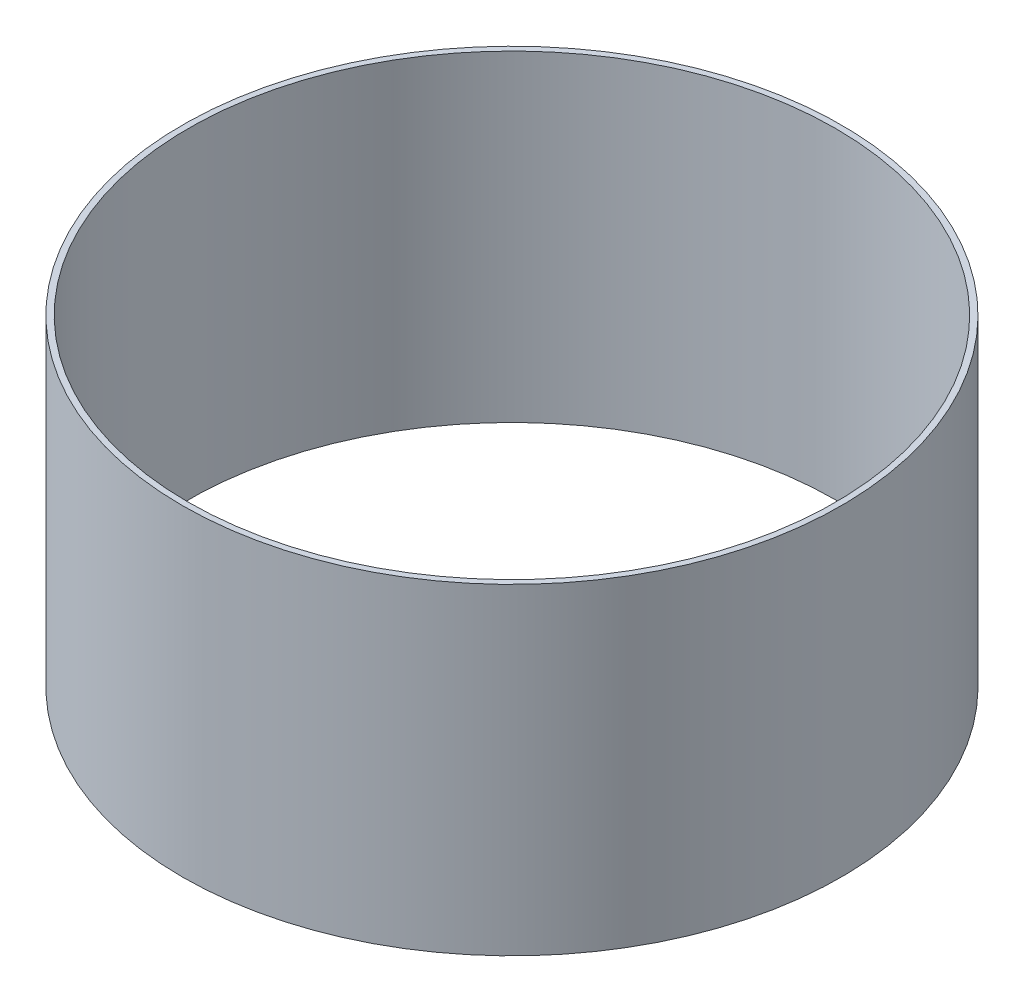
ISO-10303-21;
HEADER;
FILE_DESCRIPTION(('STEP AP214'),'2;1');
FILE_NAME('part.step','',(''),(''),'','','');
FILE_SCHEMA(('AUTOMOTIVE_DESIGN { 1 0 10303 214 1 1 1 1 }'));
ENDSEC;
DATA;
#1=APPLICATION_CONTEXT('core data for automotive mechanical design processes');
#2=APPLICATION_PROTOCOL_DEFINITION('international standard','automotive_design',2000,#1);
#3=PRODUCT_CONTEXT('',#1,'mechanical');
#4=PRODUCT('Part','Part','',(#3));
#5=PRODUCT_RELATED_PRODUCT_CATEGORY('part','',(#4));
#6=PRODUCT_DEFINITION_FORMATION('','',#4);
#7=PRODUCT_DEFINITION_CONTEXT('part definition',#1,'design');
#8=PRODUCT_DEFINITION('design','',#6,#7);
#9=PRODUCT_DEFINITION_SHAPE('','',#8);
#10=(LENGTH_UNIT() NAMED_UNIT(*) SI_UNIT(.MILLI.,.METRE.));
#11=(NAMED_UNIT(*) PLANE_ANGLE_UNIT() SI_UNIT($,.RADIAN.));
#12=(NAMED_UNIT(*) SI_UNIT($,.STERADIAN.) SOLID_ANGLE_UNIT());
#13=UNCERTAINTY_MEASURE_WITH_UNIT(LENGTH_MEASURE(1.E-05),#10,'distance_accuracy_value','');
#14=(GEOMETRIC_REPRESENTATION_CONTEXT(3) GLOBAL_UNCERTAINTY_ASSIGNED_CONTEXT((#13)) GLOBAL_UNIT_ASSIGNED_CONTEXT((#10,
#11,#12)) REPRESENTATION_CONTEXT('',''));
#15=CARTESIAN_POINT('',(0.,0.,0.));
#16=DIRECTION('',(0.,0.,1.));
#17=DIRECTION('',(1.,0.,0.));
#18=AXIS2_PLACEMENT_3D('',#15,#16,#17);
#19=CARTESIAN_POINT('',(0.,706.,0.));
#20=DIRECTION('',(0.,-1.,0.));
#21=DIRECTION('',(0.,0.,-1.));
#22=AXIS2_PLACEMENT_3D('',#19,#20,#21);
#23=CYLINDRICAL_SURFACE('',#22,698.3);
#24=CARTESIAN_POINT('',(0.,706.,0.));
#25=DIRECTION('',(0.,1.,0.));
#26=DIRECTION('',(0.,0.,1.));
#27=AXIS2_PLACEMENT_3D('',#24,#25,#26);
#28=CIRCLE('',#27,698.3);
#29=CARTESIAN_POINT('',(0.,706.,698.3));
#30=VERTEX_POINT('',#29);
#31=EDGE_CURVE('E48',#30,#30,#28,.T.);
#32=ORIENTED_EDGE('',*,*,#31,.T.);
#33=EDGE_LOOP('',(#32));
#34=FACE_BOUND('',#33,.T.);
#35=CARTESIAN_POINT('',(0.,12.,0.));
#36=DIRECTION('',(0.,1.,0.));
#37=DIRECTION('',(0.,0.,1.));
#38=AXIS2_PLACEMENT_3D('',#35,#36,#37);
#39=CIRCLE('',#38,698.3);
#40=CARTESIAN_POINT('',(0.,12.,698.3));
#41=VERTEX_POINT('',#40);
#42=EDGE_CURVE('E54',#41,#41,#39,.T.);
#43=ORIENTED_EDGE('',*,*,#42,.F.);
#44=EDGE_LOOP('',(#43));
#45=FACE_BOUND('',#44,.T.);
#46=ADVANCED_FACE('F41',(#34,#45),#23,.F.);
#47=CARTESIAN_POINT('',(0.,706.,0.));
#48=DIRECTION('',(0.,-1.,0.));
#49=DIRECTION('',(0.,0.,-1.));
#50=AXIS2_PLACEMENT_3D('',#47,#48,#49);
#51=CYLINDRICAL_SURFACE('',#50,711.);
#52=CARTESIAN_POINT('',(0.,706.,0.));
#53=DIRECTION('',(0.,1.,0.));
#54=DIRECTION('',(0.,0.,1.));
#55=AXIS2_PLACEMENT_3D('',#52,#53,#54);
#56=CIRCLE('',#55,711.);
#57=CARTESIAN_POINT('',(0.,706.,711.));
#58=VERTEX_POINT('',#57);
#59=EDGE_CURVE('E11',#58,#58,#56,.T.);
#60=ORIENTED_EDGE('',*,*,#59,.F.);
#61=EDGE_LOOP('',(#60));
#62=FACE_BOUND('',#61,.T.);
#63=CARTESIAN_POINT('',(0.,12.,0.));
#64=DIRECTION('',(0.,1.,0.));
#65=DIRECTION('',(0.,0.,1.));
#66=AXIS2_PLACEMENT_3D('',#63,#64,#65);
#67=CIRCLE('',#66,711.);
#68=CARTESIAN_POINT('',(0.,12.,711.));
#69=VERTEX_POINT('',#68);
#70=EDGE_CURVE('E44',#69,#69,#67,.T.);
#71=ORIENTED_EDGE('',*,*,#70,.T.);
#72=EDGE_LOOP('',(#71));
#73=FACE_BOUND('',#72,.T.);
#74=ADVANCED_FACE('F61',(#62,#73),#51,.T.);
#75=CARTESIAN_POINT('',(0.,706.,0.));
#76=DIRECTION('',(0.,1.,0.));
#77=DIRECTION('',(0.,0.,1.));
#78=AXIS2_PLACEMENT_3D('',#75,#76,#77);
#79=PLANE('',#78);
#80=ORIENTED_EDGE('',*,*,#31,.F.);
#81=EDGE_LOOP('',(#80));
#82=FACE_BOUND('',#81,.T.);
#83=ORIENTED_EDGE('',*,*,#59,.T.);
#84=EDGE_LOOP('',(#83));
#85=FACE_BOUND('',#84,.T.);
#86=ADVANCED_FACE('F65',(#82,#85),#79,.T.);
#87=CARTESIAN_POINT('',(0.,12.,0.));
#88=DIRECTION('',(0.,1.,0.));
#89=DIRECTION('',(0.,0.,1.));
#90=AXIS2_PLACEMENT_3D('',#87,#88,#89);
#91=PLANE('',#90);
#92=ORIENTED_EDGE('',*,*,#42,.T.);
#93=EDGE_LOOP('',(#92));
#94=FACE_BOUND('',#93,.T.);
#95=ORIENTED_EDGE('',*,*,#70,.F.);
#96=EDGE_LOOP('',(#95));
#97=FACE_BOUND('',#96,.T.);
#98=ADVANCED_FACE('F63',(#94,#97),#91,.F.);
#99=CLOSED_SHELL('',(#46,#74,#86,#98));
#100=MANIFOLD_SOLID_BREP('B2',#99);
#101=ADVANCED_BREP_SHAPE_REPRESENTATION('',(#18,#100),#14);
#102=SHAPE_DEFINITION_REPRESENTATION(#9,#101);
ENDSEC;
END-ISO-10303-21;
